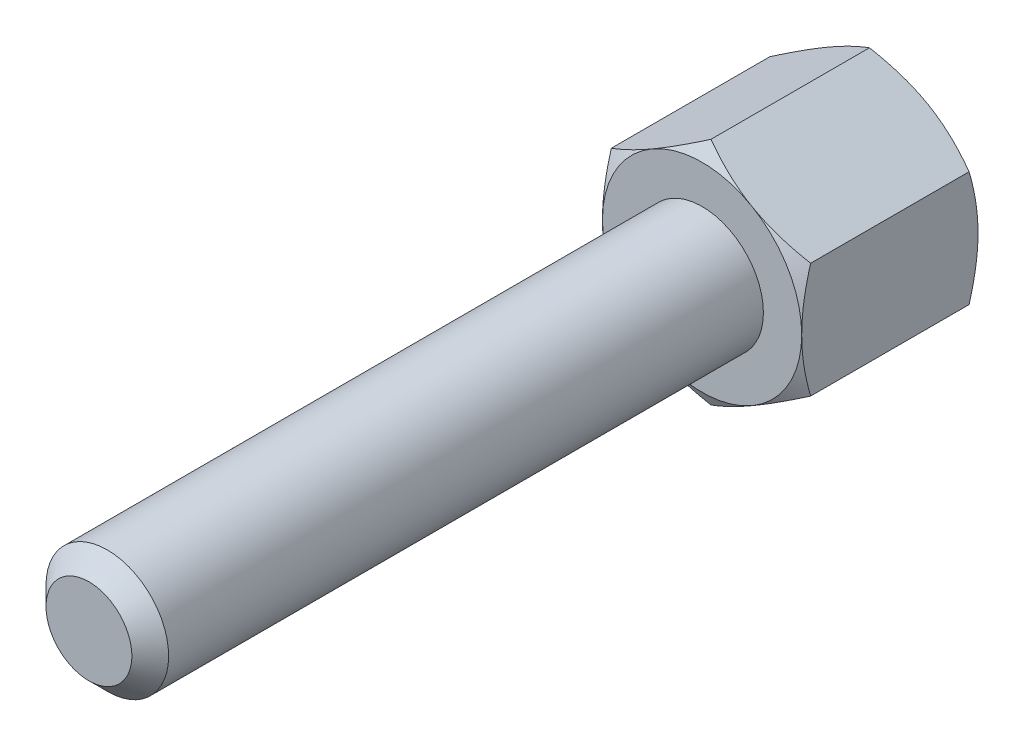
ISO-10303-21;
HEADER;
FILE_DESCRIPTION(('STEP AP214'),'2;1');
FILE_NAME('part.step','',(''),(''),'','','');
FILE_SCHEMA(('AUTOMOTIVE_DESIGN { 1 0 10303 214 1 1 1 1 }'));
ENDSEC;
DATA;
#1=APPLICATION_CONTEXT('core data for automotive mechanical design processes');
#2=APPLICATION_PROTOCOL_DEFINITION('international standard','automotive_design',2000,#1);
#3=PRODUCT_CONTEXT('',#1,'mechanical');
#4=PRODUCT('Part','Part','',(#3));
#5=PRODUCT_RELATED_PRODUCT_CATEGORY('part','',(#4));
#6=PRODUCT_DEFINITION_FORMATION('','',#4);
#7=PRODUCT_DEFINITION_CONTEXT('part definition',#1,'design');
#8=PRODUCT_DEFINITION('design','',#6,#7);
#9=PRODUCT_DEFINITION_SHAPE('','',#8);
#10=(LENGTH_UNIT() NAMED_UNIT(*) SI_UNIT(.MILLI.,.METRE.));
#11=(NAMED_UNIT(*) PLANE_ANGLE_UNIT() SI_UNIT($,.RADIAN.));
#12=(NAMED_UNIT(*) SI_UNIT($,.STERADIAN.) SOLID_ANGLE_UNIT());
#13=UNCERTAINTY_MEASURE_WITH_UNIT(LENGTH_MEASURE(1.E-05),#10,'distance_accuracy_value','');
#14=(GEOMETRIC_REPRESENTATION_CONTEXT(3) GLOBAL_UNCERTAINTY_ASSIGNED_CONTEXT((#13)) GLOBAL_UNIT_ASSIGNED_CONTEXT((#10,
#11,#12)) REPRESENTATION_CONTEXT('',''));
#15=CARTESIAN_POINT('',(0.,0.,0.));
#16=DIRECTION('',(0.,0.,1.));
#17=DIRECTION('',(1.,0.,0.));
#18=AXIS2_PLACEMENT_3D('',#15,#16,#17);
#19=CARTESIAN_POINT('',(0.,-7.50555349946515,23.));
#20=DIRECTION('',(-0.5,-0.866025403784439,0.));
#21=DIRECTION('',(-0.866025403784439,0.5,0.));
#22=AXIS2_PLACEMENT_3D('',#19,#20,#21);
#23=PLANE('',#22);
#24=DIRECTION('',(0.,0.,-1.));
#25=VECTOR('',#24,1.);
#26=CARTESIAN_POINT('',(-6.5,-3.75277674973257,23.));
#27=LINE('',#26,#25);
#28=CARTESIAN_POINT('',(-6.5,-3.75277674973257,12.4194434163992));
#29=VERTEX_POINT('',#28);
#30=CARTESIAN_POINT('',(-6.5,-3.75277674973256,2.08055658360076));
#31=VERTEX_POINT('',#30);
#32=EDGE_CURVE('E134',#29,#31,#27,.T.);
#33=ORIENTED_EDGE('',*,*,#32,.T.);
#34=CARTESIAN_POINT('',(-6.5002,-3.75266127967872,2.08062325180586));
#35=CARTESIAN_POINT('',(-6.35732254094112,-3.8351516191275,2.03300442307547));
#36=CARTESIAN_POINT('',(-6.21391236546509,-3.91794952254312,1.98754670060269));
#37=CARTESIAN_POINT('',(-5.92592736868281,-4.08421773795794,1.90154868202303));
#38=CARTESIAN_POINT('',(-5.78135207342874,-4.16768832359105,1.86101050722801));
#39=CARTESIAN_POINT('',(-5.34531134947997,-4.41943655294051,1.74757100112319));
#40=CARTESIAN_POINT('',(-5.05212471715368,-4.58870793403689,1.68304780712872));
#41=CARTESIAN_POINT('',(-4.61337625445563,-4.84201947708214,1.60738658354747));
#42=CARTESIAN_POINT('',(-4.46912536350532,-4.92530276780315,1.58583285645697));
#43=CARTESIAN_POINT('',(-4.17997178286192,-5.09224566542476,1.5496903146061));
#44=CARTESIAN_POINT('',(-4.03506915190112,-5.17590523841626,1.53510088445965));
#45=CARTESIAN_POINT('',(-3.74501222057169,-5.34336968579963,1.51325875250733));
#46=CARTESIAN_POINT('',(-3.5998583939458,-5.42717428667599,1.50599772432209));
#47=CARTESIAN_POINT('',(-3.30942466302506,-5.59485627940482,1.49896030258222));
#48=CARTESIAN_POINT('',(-3.16414476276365,-5.67873366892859,1.4991836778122));
#49=CARTESIAN_POINT('',(-2.76612405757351,-5.90853103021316,1.51008345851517));
#50=CARTESIAN_POINT('',(-2.51351353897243,-6.05437578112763,1.5283818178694));
#51=CARTESIAN_POINT('',(-2.00997032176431,-6.34509659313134,1.58640634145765));
#52=CARTESIAN_POINT('',(-1.7590393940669,-6.48997163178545,1.62615233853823));
#53=CARTESIAN_POINT('',(-1.25448277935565,-6.78127752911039,1.72550590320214));
#54=CARTESIAN_POINT('',(-1.00092075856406,-6.92767163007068,1.78553442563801));
#55=CARTESIAN_POINT('',(-0.497578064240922,-7.21827667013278,1.92177499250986));
#56=CARTESIAN_POINT('',(-0.247790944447,-7.3624913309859,1.99795503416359));
#57=CARTESIAN_POINT('',(0.000200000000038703,-7.50566896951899,2.08062325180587));
#58=B_SPLINE_CURVE_WITH_KNOTS('',3,(#34,#35,#36,#37,#38,#39,#40,#41,#42,#43,#44,#45,#46,#47,#48,
#49,#50,#51,#52,#53,#54,#55,#56,#57),.UNSPECIFIED.,.F.,.F.,(4,2,2,2,2,2,2,2,2,2,2,4),(0.,
0.515105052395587,1.03043143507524,2.06322554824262,2.56697389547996,3.07067772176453,
3.57380860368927,4.0769239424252,4.95279354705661,5.82947446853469,6.7255991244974,
7.61996451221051),.UNSPECIFIED.);
#59=CARTESIAN_POINT('',(-3.25,-5.62916512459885,1.5));
#60=VERTEX_POINT('',#59);
#61=EDGE_CURVE('E113',#31,#60,#58,.T.);
#62=ORIENTED_EDGE('',*,*,#61,.T.);
#63=CARTESIAN_POINT('',(0.,-7.50555349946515,2.08055658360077));
#64=VERTEX_POINT('',#63);
#65=EDGE_CURVE('E124',#60,#64,#58,.T.);
#66=ORIENTED_EDGE('',*,*,#65,.T.);
#67=DIRECTION('',(0.,0.,-1.));
#68=VECTOR('',#67,1.);
#69=CARTESIAN_POINT('',(0.,-7.50555349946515,23.));
#70=LINE('',#69,#68);
#71=CARTESIAN_POINT('',(0.,-7.50555349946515,12.4194434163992));
#72=VERTEX_POINT('',#71);
#73=EDGE_CURVE('E312',#72,#64,#70,.T.);
#74=ORIENTED_EDGE('',*,*,#73,.F.);
#75=CARTESIAN_POINT('',(0.000200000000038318,-7.50566896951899,12.4193767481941));
#76=CARTESIAN_POINT('',(-0.142677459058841,-7.42317863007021,12.4669955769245));
#77=CARTESIAN_POINT('',(-0.286087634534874,-7.3403807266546,12.5124532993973));
#78=CARTESIAN_POINT('',(-0.574072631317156,-7.17411251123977,12.5984513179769));
#79=CARTESIAN_POINT('',(-0.718647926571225,-7.09064192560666,12.638989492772));
#80=CARTESIAN_POINT('',(-1.15468865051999,-6.8388936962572,12.7524289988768));
#81=CARTESIAN_POINT('',(-1.44787528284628,-6.66962231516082,12.8169521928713));
#82=CARTESIAN_POINT('',(-1.88662374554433,-6.41631077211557,12.8926134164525));
#83=CARTESIAN_POINT('',(-2.03087463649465,-6.33302748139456,12.914167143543));
#84=CARTESIAN_POINT('',(-2.32002821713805,-6.16608458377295,12.9503096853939));
#85=CARTESIAN_POINT('',(-2.46493084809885,-6.08242501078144,12.9648991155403));
#86=CARTESIAN_POINT('',(-2.75498777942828,-5.91496056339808,12.9867412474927));
#87=CARTESIAN_POINT('',(-2.90014160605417,-5.83115596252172,12.9940022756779));
#88=CARTESIAN_POINT('',(-3.19057533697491,-5.66347396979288,13.0010396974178));
#89=CARTESIAN_POINT('',(-3.33585523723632,-5.57959658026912,13.0008163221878));
#90=CARTESIAN_POINT('',(-3.73387594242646,-5.34979921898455,12.9899165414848));
#91=CARTESIAN_POINT('',(-3.98648646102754,-5.20395446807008,12.9716181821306));
#92=CARTESIAN_POINT('',(-4.49002967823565,-4.91323365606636,12.9135936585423));
#93=CARTESIAN_POINT('',(-4.74096060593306,-4.76835861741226,12.8738476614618));
#94=CARTESIAN_POINT('',(-5.24551722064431,-4.47705272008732,12.7744940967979));
#95=CARTESIAN_POINT('',(-5.4990792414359,-4.33065861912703,12.714465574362));
#96=CARTESIAN_POINT('',(-6.00242193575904,-4.04005357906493,12.5782250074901));
#97=CARTESIAN_POINT('',(-6.25220905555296,-3.89583891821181,12.5020449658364));
#98=CARTESIAN_POINT('',(-6.5002,-3.75266127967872,12.4193767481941));
#99=B_SPLINE_CURVE_WITH_KNOTS('',3,(#75,#76,#77,#78,#79,#80,#81,#82,#83,#84,#85,#86,#87,#88,#89,
#90,#91,#92,#93,#94,#95,#96,#97,#98),.UNSPECIFIED.,.F.,.F.,(4,2,2,2,2,2,2,2,2,2,2,4),(0.,
0.515105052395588,1.03043143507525,2.06322554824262,2.56697389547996,3.07067772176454,
3.57380860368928,4.0769239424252,4.95279354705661,5.82947446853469,6.7255991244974,
7.6199645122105),.UNSPECIFIED.);
#100=CARTESIAN_POINT('',(-3.25,-5.62916512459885,13.));
#101=VERTEX_POINT('',#100);
#102=EDGE_CURVE('E310',#72,#101,#99,.T.);
#103=ORIENTED_EDGE('',*,*,#102,.T.);
#104=EDGE_CURVE('E199',#101,#29,#99,.T.);
#105=ORIENTED_EDGE('',*,*,#104,.T.);
#106=EDGE_LOOP('',(#33,#62,#66,#74,#103,#105));
#107=FACE_BOUND('',#106,.T.);
#108=ADVANCED_FACE('F14',(#107),#23,.T.);
#109=CARTESIAN_POINT('',(-6.5,-3.75277674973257,23.));
#110=DIRECTION('',(-1.,0.,0.));
#111=DIRECTION('',(0.,0.,-1.));
#112=AXIS2_PLACEMENT_3D('',#109,#110,#111);
#113=PLANE('',#112);
#114=DIRECTION('',(0.,0.,-1.));
#115=VECTOR('',#114,1.);
#116=CARTESIAN_POINT('',(-6.5,3.75277674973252,23.));
#117=LINE('',#116,#115);
#118=CARTESIAN_POINT('',(-6.5,3.75277674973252,12.4194434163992));
#119=VERTEX_POINT('',#118);
#120=CARTESIAN_POINT('',(-6.5,3.75277674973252,2.08055658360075));
#121=VERTEX_POINT('',#120);
#122=EDGE_CURVE('E270',#119,#121,#117,.T.);
#123=ORIENTED_EDGE('',*,*,#122,.T.);
#124=CARTESIAN_POINT('',(-6.5,-10.0686297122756,4.66645500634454));
#125=CARTESIAN_POINT('',(-6.5,-9.78483615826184,4.52883712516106));
#126=CARTESIAN_POINT('',(-6.5,-9.50038987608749,4.39254217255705));
#127=CARTESIAN_POINT('',(-6.5,-8.92984471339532,4.12334238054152));
#128=CARTESIAN_POINT('',(-6.5,-8.64374557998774,3.9904380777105));
#129=CARTESIAN_POINT('',(-6.5,-8.06806779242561,3.72809265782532));
#130=CARTESIAN_POINT('',(-6.5,-7.77847866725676,3.59867443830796));
#131=CARTESIAN_POINT('',(-6.5,-7.1969930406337,3.34514981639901));
#132=CARTESIAN_POINT('',(-6.5,-6.90509664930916,3.22104316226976));
#133=CARTESIAN_POINT('',(-6.5,-6.30914437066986,2.97567911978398));
#134=CARTESIAN_POINT('',(-6.5,-6.00499819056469,2.85463984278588));
#135=CARTESIAN_POINT('',(-6.5,-5.39314282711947,2.62175066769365));
#136=CARTESIAN_POINT('',(-6.5,-5.08543324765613,2.50990180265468));
#137=CARTESIAN_POINT('',(-6.5,-4.4665425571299,2.29833808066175));
#138=CARTESIAN_POINT('',(-6.5,-4.15536996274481,2.19859855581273));
#139=CARTESIAN_POINT('',(-6.5,-3.52855782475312,2.01446301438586));
#140=CARTESIAN_POINT('',(-6.5,-3.21291972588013,1.9300621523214));
#141=CARTESIAN_POINT('',(-6.5,-2.57876921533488,1.78110829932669));
#142=CARTESIAN_POINT('',(-6.5,-2.26028247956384,1.71644774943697));
#143=CARTESIAN_POINT('',(-6.5,-1.61931557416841,1.61065008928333));
#144=CARTESIAN_POINT('',(-6.5,-1.29683578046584,1.56951078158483));
#145=CARTESIAN_POINT('',(-6.5,-0.813547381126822,1.52817461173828));
#146=CARTESIAN_POINT('',(-6.5,-0.653569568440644,1.51779431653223));
#147=CARTESIAN_POINT('',(-6.5,-0.333311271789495,1.50380157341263));
#148=CARTESIAN_POINT('',(-6.5,-0.173030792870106,1.50018901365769));
#149=CARTESIAN_POINT('',(-6.5,0.147537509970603,1.49982541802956));
#150=CARTESIAN_POINT('',(-6.5,0.307825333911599,1.50307440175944));
#151=CARTESIAN_POINT('',(-6.5,0.628122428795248,1.51635267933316));
#152=CARTESIAN_POINT('',(-6.5,0.788131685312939,1.52638231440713));
#153=CARTESIAN_POINT('',(-6.5,1.17304986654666,1.55845438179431));
#154=CARTESIAN_POINT('',(-6.5,1.39769460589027,1.58373467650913));
#155=CARTESIAN_POINT('',(-6.5,1.84529842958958,1.64627911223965));
#156=CARTESIAN_POINT('',(-6.5,2.06825727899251,1.68354489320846));
#157=CARTESIAN_POINT('',(-6.5,2.73436107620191,1.81134295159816));
#158=CARTESIAN_POINT('',(-6.5,3.17448023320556,1.91785208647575));
#159=CARTESIAN_POINT('',(-6.5,3.83253872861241,2.102314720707));
#160=CARTESIAN_POINT('',(-6.5,4.053897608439,2.16876892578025));
#161=CARTESIAN_POINT('',(-6.5,4.49446508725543,2.3085224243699));
#162=CARTESIAN_POINT('',(-6.5,4.71367367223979,2.38182176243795));
#163=CARTESIAN_POINT('',(-6.5,5.15001039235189,2.53409424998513));
#164=CARTESIAN_POINT('',(-6.5,5.36713920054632,2.61306548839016));
#165=CARTESIAN_POINT('',(-6.5,5.799601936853,2.77575833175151));
#166=CARTESIAN_POINT('',(-6.5,6.01493588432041,2.85947988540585));
#167=CARTESIAN_POINT('',(-6.5,6.51613914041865,3.05969844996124));
#168=CARTESIAN_POINT('',(-6.5,6.8013853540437,3.17775218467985));
#169=CARTESIAN_POINT('',(-6.5,7.36950297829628,3.4194578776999));
#170=CARTESIAN_POINT('',(-6.5,7.65237425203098,3.54311015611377));
#171=CARTESIAN_POINT('',(-6.5,8.21616884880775,3.79490928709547));
#172=CARTESIAN_POINT('',(-6.5,8.49709178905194,3.92305699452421));
#173=CARTESIAN_POINT('',(-6.5,9.05726492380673,4.18296407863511));
#174=CARTESIAN_POINT('',(-6.5,9.33651508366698,4.31472352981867));
#175=CARTESIAN_POINT('',(-6.5,9.89389202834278,4.58132185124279));
#176=CARTESIAN_POINT('',(-6.5,10.172017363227,4.71616374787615));
#177=CARTESIAN_POINT('',(-6.5,10.727076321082,4.98828060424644));
#178=CARTESIAN_POINT('',(-6.5,11.004009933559,5.12555558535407));
#179=CARTESIAN_POINT('',(-6.5,11.8332331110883,5.540358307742));
#180=CARTESIAN_POINT('',(-6.5,12.3840158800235,5.82089799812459));
#181=CARTESIAN_POINT('',(-6.5,13.4376729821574,6.36445572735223));
#182=CARTESIAN_POINT('',(-6.5,13.9407782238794,6.62702814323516));
#183=CARTESIAN_POINT('',(-6.5,14.9451021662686,7.15579431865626));
#184=CARTESIAN_POINT('',(-6.5,15.4463208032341,7.42198819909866));
#185=CARTESIAN_POINT('',(-6.5,16.4460730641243,7.95649533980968));
#186=CARTESIAN_POINT('',(-6.5,16.9446102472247,8.22480195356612));
#187=CARTESIAN_POINT('',(-6.5,17.9404739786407,8.76359021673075));
#188=CARTESIAN_POINT('',(-6.5,18.4378005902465,9.03407174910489));
#189=CARTESIAN_POINT('',(-6.5,18.9346796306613,9.30536745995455));
#190=B_SPLINE_CURVE_WITH_KNOTS('',3,(#124,#125,#126,#127,#128,#129,#130,#131,#132,#133,#134,
#135,#136,#137,#138,#139,#140,#141,#142,#143,#144,#145,#146,#147,#148,#149,#150,#151,#152,#153,
#154,#155,#156,#157,#158,#159,#160,#161,#162,#163,#164,#165,#166,#167,#168,#169,#170,#171,#172,
#173,#174,#175,#176,#177,#178,#179,#180,#181,#182,#183,#184,#185,#186,#187,#188,#189),
.UNSPECIFIED.,.F.,.F.,(4,2,2,2,2,2,2,2,2,2,2,2,2,2,2,2,2,2,2,2,2,2,2,2,2,2,2,2,2,2,2,2,4),(0.,
0.946213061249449,1.89257494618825,2.8441090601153,3.79559802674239,4.77752138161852,
5.75955495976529,6.73955322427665,7.7192413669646,8.69349208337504,9.66765176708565,
10.1484730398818,10.6292863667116,11.1101010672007,11.5909399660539,12.2687449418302,
12.9466426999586,14.3031972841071,14.9964966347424,15.6898004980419,16.3828718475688,
17.0759357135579,18.0019870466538,18.9280913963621,19.8543728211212,20.7806733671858,
21.7079261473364,22.6351870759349,24.4894729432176,26.1919648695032,27.8945137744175,
29.5929631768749,31.2913217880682),.UNSPECIFIED.);
#191=CARTESIAN_POINT('',(-6.5,0.,1.5));
#192=VERTEX_POINT('',#191);
#193=EDGE_CURVE('E253',#121,#192,#190,.F.);
#194=ORIENTED_EDGE('',*,*,#193,.T.);
#195=EDGE_CURVE('E115',#192,#31,#190,.F.);
#196=ORIENTED_EDGE('',*,*,#195,.T.);
#197=ORIENTED_EDGE('',*,*,#32,.F.);
#198=CARTESIAN_POINT('',(-6.5,-10.0686297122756,9.83354499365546));
#199=CARTESIAN_POINT('',(-6.5,-9.78483615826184,9.97116287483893));
#200=CARTESIAN_POINT('',(-6.5,-9.50038987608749,10.1074578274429));
#201=CARTESIAN_POINT('',(-6.5,-8.92984471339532,10.3766576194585));
#202=CARTESIAN_POINT('',(-6.5,-8.64374557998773,10.5095619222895));
#203=CARTESIAN_POINT('',(-6.5,-8.0680677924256,10.7719073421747));
#204=CARTESIAN_POINT('',(-6.5,-7.77847866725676,10.901325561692));
#205=CARTESIAN_POINT('',(-6.5,-7.1969930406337,11.154850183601));
#206=CARTESIAN_POINT('',(-6.5,-6.90509664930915,11.2789568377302));
#207=CARTESIAN_POINT('',(-6.5,-6.30914437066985,11.524320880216));
#208=CARTESIAN_POINT('',(-6.5,-6.00499819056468,11.6453601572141));
#209=CARTESIAN_POINT('',(-6.5,-5.39314282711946,11.8782493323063));
#210=CARTESIAN_POINT('',(-6.5,-5.08543324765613,11.9900981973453));
#211=CARTESIAN_POINT('',(-6.5,-4.46654255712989,12.2016619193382));
#212=CARTESIAN_POINT('',(-6.5,-4.1553699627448,12.3014014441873));
#213=CARTESIAN_POINT('',(-6.5,-3.52855782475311,12.4855369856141));
#214=CARTESIAN_POINT('',(-6.5,-3.21291972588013,12.5699378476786));
#215=CARTESIAN_POINT('',(-6.5,-2.57876921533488,12.7188917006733));
#216=CARTESIAN_POINT('',(-6.5,-2.26028247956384,12.783552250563));
#217=CARTESIAN_POINT('',(-6.5,-1.61931557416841,12.8893499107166));
#218=CARTESIAN_POINT('',(-6.5,-1.29683578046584,12.9304892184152));
#219=CARTESIAN_POINT('',(-6.5,-0.813547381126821,12.9718253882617));
#220=CARTESIAN_POINT('',(-6.5,-0.653569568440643,12.9822056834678));
#221=CARTESIAN_POINT('',(-6.5,-0.333311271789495,12.9961984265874));
#222=CARTESIAN_POINT('',(-6.5,-0.173030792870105,12.9998109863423));
#223=CARTESIAN_POINT('',(-6.5,0.147537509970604,13.0001745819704));
#224=CARTESIAN_POINT('',(-6.5,0.3078253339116,12.9969255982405));
#225=CARTESIAN_POINT('',(-6.5,0.628122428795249,12.9836473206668));
#226=CARTESIAN_POINT('',(-6.5,0.788131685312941,12.9736176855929));
#227=CARTESIAN_POINT('',(-6.5,1.17304986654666,12.9415456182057));
#228=CARTESIAN_POINT('',(-6.5,1.39769460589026,12.9162653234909));
#229=CARTESIAN_POINT('',(-6.5,1.84529842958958,12.8537208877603));
#230=CARTESIAN_POINT('',(-6.5,2.0682572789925,12.8164551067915));
#231=CARTESIAN_POINT('',(-6.5,2.7343610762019,12.6886570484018));
#232=CARTESIAN_POINT('',(-6.5,3.17448023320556,12.5821479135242));
#233=CARTESIAN_POINT('',(-6.5,3.8325387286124,12.397685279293));
#234=CARTESIAN_POINT('',(-6.5,4.05389760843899,12.3312310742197));
#235=CARTESIAN_POINT('',(-6.5,4.49446508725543,12.1914775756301));
#236=CARTESIAN_POINT('',(-6.5,4.71367367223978,12.118178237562));
#237=CARTESIAN_POINT('',(-6.5,5.15001039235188,11.9659057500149));
#238=CARTESIAN_POINT('',(-6.5,5.36713920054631,11.8869345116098));
#239=CARTESIAN_POINT('',(-6.5,5.79960193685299,11.7242416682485));
#240=CARTESIAN_POINT('',(-6.5,6.01493588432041,11.6405201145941));
#241=CARTESIAN_POINT('',(-6.5,6.51613914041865,11.4403015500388));
#242=CARTESIAN_POINT('',(-6.5,6.80138535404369,11.3222478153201));
#243=CARTESIAN_POINT('',(-6.5,7.36950297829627,11.0805421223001));
#244=CARTESIAN_POINT('',(-6.5,7.65237425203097,10.9568898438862));
#245=CARTESIAN_POINT('',(-6.5,8.21616884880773,10.7050907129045));
#246=CARTESIAN_POINT('',(-6.5,8.49709178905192,10.5769430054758));
#247=CARTESIAN_POINT('',(-6.5,9.05726492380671,10.3170359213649));
#248=CARTESIAN_POINT('',(-6.5,9.33651508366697,10.1852764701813));
#249=CARTESIAN_POINT('',(-6.5,9.89389202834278,9.91867814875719));
#250=CARTESIAN_POINT('',(-6.5,10.1720173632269,9.78383625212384));
#251=CARTESIAN_POINT('',(-6.5,10.727076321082,9.51171939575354));
#252=CARTESIAN_POINT('',(-6.5,11.004009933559,9.37444441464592));
#253=CARTESIAN_POINT('',(-6.5,11.8332331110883,8.95964169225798));
#254=CARTESIAN_POINT('',(-6.5,12.3840158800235,8.6791020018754));
#255=CARTESIAN_POINT('',(-6.5,13.4376729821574,8.13554427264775));
#256=CARTESIAN_POINT('',(-6.5,13.9407782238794,7.87297185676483));
#257=CARTESIAN_POINT('',(-6.5,14.9451021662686,7.34420568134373));
#258=CARTESIAN_POINT('',(-6.5,15.4463208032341,7.07801180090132));
#259=CARTESIAN_POINT('',(-6.5,16.4460730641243,6.54350466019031));
#260=CARTESIAN_POINT('',(-6.5,16.9446102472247,6.27519804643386));
#261=CARTESIAN_POINT('',(-6.5,17.9404739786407,5.73640978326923));
#262=CARTESIAN_POINT('',(-6.5,18.4378005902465,5.46592825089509));
#263=CARTESIAN_POINT('',(-6.5,18.9346796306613,5.19463254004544));
#264=B_SPLINE_CURVE_WITH_KNOTS('',3,(#198,#199,#200,#201,#202,#203,#204,#205,#206,#207,#208,
#209,#210,#211,#212,#213,#214,#215,#216,#217,#218,#219,#220,#221,#222,#223,#224,#225,#226,#227,
#228,#229,#230,#231,#232,#233,#234,#235,#236,#237,#238,#239,#240,#241,#242,#243,#244,#245,#246,
#247,#248,#249,#250,#251,#252,#253,#254,#255,#256,#257,#258,#259,#260,#261,#262,#263),
.UNSPECIFIED.,.F.,.F.,(4,2,2,2,2,2,2,2,2,2,2,2,2,2,2,2,2,2,2,2,2,2,2,2,2,2,2,2,2,2,2,2,4),(0.,
0.946213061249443,1.89257494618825,2.8441090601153,3.79559802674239,4.77752138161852,
5.75955495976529,6.73955322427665,7.71924136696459,8.69349208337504,9.66765176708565,
10.1484730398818,10.6292863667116,11.1101010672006,11.5909399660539,12.2687449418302,
12.9466426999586,14.3031972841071,14.9964966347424,15.6898004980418,16.3828718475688,
17.0759357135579,18.0019870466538,18.928091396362,19.8543728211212,20.7806733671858,
21.7079261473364,22.6351870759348,24.4894729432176,26.1919648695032,27.8945137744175,
29.5929631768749,31.2913217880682),.UNSPECIFIED.);
#265=CARTESIAN_POINT('',(-6.5,0.,13.));
#266=VERTEX_POINT('',#265);
#267=EDGE_CURVE('E209',#29,#266,#264,.T.);
#268=ORIENTED_EDGE('',*,*,#267,.T.);
#269=EDGE_CURVE('E229',#266,#119,#264,.T.);
#270=ORIENTED_EDGE('',*,*,#269,.T.);
#271=EDGE_LOOP('',(#123,#194,#196,#197,#268,#270));
#272=FACE_BOUND('',#271,.T.);
#273=ADVANCED_FACE('F233',(#272),#113,.T.);
#274=CARTESIAN_POINT('',(0.,7.50555349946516,23.));
#275=DIRECTION('',(0.500000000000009,-0.866025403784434,0.));
#276=DIRECTION('',(-0.866025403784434,-0.500000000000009,0.));
#277=AXIS2_PLACEMENT_3D('',#274,#275,#276);
#278=PLANE('',#277);
#279=CARTESIAN_POINT('',(-6.5002,3.75266127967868,2.08062325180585));
#280=CARTESIAN_POINT('',(-6.35732254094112,3.83515161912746,2.03300442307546));
#281=CARTESIAN_POINT('',(-6.21391236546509,3.91794952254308,1.98754670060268));
#282=CARTESIAN_POINT('',(-5.92592736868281,4.08421773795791,1.90154868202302));
#283=CARTESIAN_POINT('',(-5.78135207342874,4.16768832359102,1.861010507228));
#284=CARTESIAN_POINT('',(-5.34531134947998,4.41943655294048,1.74757100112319));
#285=CARTESIAN_POINT('',(-5.05212471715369,4.58870793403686,1.68304780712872));
#286=CARTESIAN_POINT('',(-4.61337625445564,4.84201947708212,1.60738658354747));
#287=CARTESIAN_POINT('',(-4.46912536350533,4.92530276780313,1.58583285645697));
#288=CARTESIAN_POINT('',(-4.17997178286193,5.09224566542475,1.5496903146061));
#289=CARTESIAN_POINT('',(-4.03506915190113,5.17590523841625,1.53510088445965));
#290=CARTESIAN_POINT('',(-3.7450122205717,5.34336968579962,1.51325875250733));
#291=CARTESIAN_POINT('',(-3.59985839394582,5.42717428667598,1.50599772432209));
#292=CARTESIAN_POINT('',(-3.30942466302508,5.59485627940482,1.49896030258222));
#293=CARTESIAN_POINT('',(-3.16414476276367,5.67873366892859,1.4991836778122));
#294=CARTESIAN_POINT('',(-2.76612405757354,5.90853103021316,1.51008345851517));
#295=CARTESIAN_POINT('',(-2.51351353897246,6.05437578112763,1.52838181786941));
#296=CARTESIAN_POINT('',(-2.00997032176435,6.34509659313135,1.58640634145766));
#297=CARTESIAN_POINT('',(-1.75903939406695,6.48997163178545,1.62615233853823));
#298=CARTESIAN_POINT('',(-1.25448277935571,6.7812775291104,1.72550590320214));
#299=CARTESIAN_POINT('',(-1.00092075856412,6.92767163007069,1.78553442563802));
#300=CARTESIAN_POINT('',(-0.497578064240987,7.21827667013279,1.92177499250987));
#301=CARTESIAN_POINT('',(-0.247790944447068,7.36249133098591,1.99795503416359));
#302=CARTESIAN_POINT('',(0.000199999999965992,7.505668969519,2.08062325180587));
#303=B_SPLINE_CURVE_WITH_KNOTS('',3,(#279,#280,#281,#282,#283,#284,#285,#286,#287,#288,#289,
#290,#291,#292,#293,#294,#295,#296,#297,#298,#299,#300,#301,#302),.UNSPECIFIED.,.F.,.F.,(4,2,2,
2,2,2,2,2,2,2,2,4),(0.,0.515105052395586,1.03043143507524,2.06322554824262,2.56697389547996,
3.07067772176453,3.57380860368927,4.07692394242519,4.9527935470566,5.82947446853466,
6.72559912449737,7.61996451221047),.UNSPECIFIED.);
#304=CARTESIAN_POINT('',(-3.25000000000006,5.62916512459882,1.5));
#305=VERTEX_POINT('',#304);
#306=EDGE_CURVE('E244',#121,#305,#303,.T.);
#307=ORIENTED_EDGE('',*,*,#306,.F.);
#308=ORIENTED_EDGE('',*,*,#122,.F.);
#309=CARTESIAN_POINT('',(0.000199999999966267,7.505668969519,12.4193767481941));
#310=CARTESIAN_POINT('',(-0.142677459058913,7.42317863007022,12.4669955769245));
#311=CARTESIAN_POINT('',(-0.286087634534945,7.3403807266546,12.5124532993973));
#312=CARTESIAN_POINT('',(-0.574072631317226,7.17411251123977,12.5984513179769));
#313=CARTESIAN_POINT('',(-0.718647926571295,7.09064192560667,12.638989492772));
#314=CARTESIAN_POINT('',(-1.15468865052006,6.8388936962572,12.7524289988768));
#315=CARTESIAN_POINT('',(-1.44787528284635,6.66962231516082,12.8169521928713));
#316=CARTESIAN_POINT('',(-1.8866237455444,6.41631077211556,12.8926134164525));
#317=CARTESIAN_POINT('',(-2.03087463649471,6.33302748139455,12.914167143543));
#318=CARTESIAN_POINT('',(-2.32002821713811,6.16608458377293,12.9503096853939));
#319=CARTESIAN_POINT('',(-2.46493084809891,6.08242501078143,12.9648991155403));
#320=CARTESIAN_POINT('',(-2.75498777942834,5.91496056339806,12.9867412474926));
#321=CARTESIAN_POINT('',(-2.90014160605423,5.8311559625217,12.9940022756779));
#322=CARTESIAN_POINT('',(-3.19057533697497,5.66347396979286,13.0010396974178));
#323=CARTESIAN_POINT('',(-3.33585523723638,5.57959658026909,13.0008163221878));
#324=CARTESIAN_POINT('',(-3.73387594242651,5.34979921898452,12.9899165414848));
#325=CARTESIAN_POINT('',(-3.98648646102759,5.20395446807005,12.9716181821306));
#326=CARTESIAN_POINT('',(-4.49002967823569,4.91323365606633,12.9135936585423));
#327=CARTESIAN_POINT('',(-4.74096060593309,4.76835861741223,12.8738476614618));
#328=CARTESIAN_POINT('',(-5.24551722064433,4.47705272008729,12.7744940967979));
#329=CARTESIAN_POINT('',(-5.49907924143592,4.33065861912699,12.714465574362));
#330=CARTESIAN_POINT('',(-6.00242193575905,4.0400535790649,12.5782250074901));
#331=CARTESIAN_POINT('',(-6.25220905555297,3.89583891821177,12.5020449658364));
#332=CARTESIAN_POINT('',(-6.5002,3.75266127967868,12.4193767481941));
#333=B_SPLINE_CURVE_WITH_KNOTS('',3,(#309,#310,#311,#312,#313,#314,#315,#316,#317,#318,#319,
#320,#321,#322,#323,#324,#325,#326,#327,#328,#329,#330,#331,#332),.UNSPECIFIED.,.F.,.F.,(4,2,2,
2,2,2,2,2,2,2,2,4),(0.,0.515105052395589,1.03043143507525,2.06322554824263,2.56697389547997,
3.07067772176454,3.57380860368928,4.07692394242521,4.95279354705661,5.82947446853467,
6.72559912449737,7.61996451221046),.UNSPECIFIED.);
#334=CARTESIAN_POINT('',(-3.25000000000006,5.62916512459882,13.));
#335=VERTEX_POINT('',#334);
#336=EDGE_CURVE('E223',#335,#119,#333,.T.);
#337=ORIENTED_EDGE('',*,*,#336,.F.);
#338=CARTESIAN_POINT('',(0.,7.50555349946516,12.4194434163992));
#339=VERTEX_POINT('',#338);
#340=EDGE_CURVE('E228',#339,#335,#333,.T.);
#341=ORIENTED_EDGE('',*,*,#340,.F.);
#342=DIRECTION('',(0.,0.,-1.));
#343=VECTOR('',#342,1.);
#344=CARTESIAN_POINT('',(0.,7.50555349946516,23.));
#345=LINE('',#344,#343);
#346=CARTESIAN_POINT('',(0.,7.50555349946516,2.08055658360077));
#347=VERTEX_POINT('',#346);
#348=EDGE_CURVE('E278',#339,#347,#345,.T.);
#349=ORIENTED_EDGE('',*,*,#348,.T.);
#350=EDGE_CURVE('E238',#305,#347,#303,.T.);
#351=ORIENTED_EDGE('',*,*,#350,.F.);
#352=EDGE_LOOP('',(#307,#308,#337,#341,#349,#351));
#353=FACE_BOUND('',#352,.T.);
#354=ADVANCED_FACE('F230',(#353),#278,.F.);
#355=CARTESIAN_POINT('',(0.,7.50555349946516,23.));
#356=DIRECTION('',(0.5,0.866025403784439,0.));
#357=DIRECTION('',(0.866025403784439,-0.5,0.));
#358=AXIS2_PLACEMENT_3D('',#355,#356,#357);
#359=PLANE('',#358);
#360=DIRECTION('',(0.,0.,-1.));
#361=VECTOR('',#360,1.);
#362=CARTESIAN_POINT('',(6.5,3.75277674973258,23.));
#363=LINE('',#362,#361);
#364=CARTESIAN_POINT('',(6.5,3.75277674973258,12.4194434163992));
#365=VERTEX_POINT('',#364);
#366=CARTESIAN_POINT('',(6.5,3.75277674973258,2.08055658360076));
#367=VERTEX_POINT('',#366);
#368=EDGE_CURVE('E290',#365,#367,#363,.T.);
#369=ORIENTED_EDGE('',*,*,#368,.T.);
#370=CARTESIAN_POINT('',(6.5002,3.75266127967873,2.08062325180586));
#371=CARTESIAN_POINT('',(6.35732254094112,3.83515161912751,2.03300442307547));
#372=CARTESIAN_POINT('',(6.21391236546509,3.91794952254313,1.98754670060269));
#373=CARTESIAN_POINT('',(5.92592736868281,4.08421773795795,1.90154868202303));
#374=CARTESIAN_POINT('',(5.78135207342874,4.16768832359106,1.86101050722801));
#375=CARTESIAN_POINT('',(5.34531134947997,4.41943655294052,1.7475710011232));
#376=CARTESIAN_POINT('',(5.05212471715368,4.5887079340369,1.68304780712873));
#377=CARTESIAN_POINT('',(4.61337625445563,4.84201947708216,1.60738658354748));
#378=CARTESIAN_POINT('',(4.46912536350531,4.92530276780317,1.58583285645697));
#379=CARTESIAN_POINT('',(4.17997178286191,5.09224566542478,1.54969031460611));
#380=CARTESIAN_POINT('',(4.03506915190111,5.17590523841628,1.53510088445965));
#381=CARTESIAN_POINT('',(3.74501222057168,5.34336968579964,1.51325875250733));
#382=CARTESIAN_POINT('',(3.59985839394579,5.427174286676,1.50599772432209));
#383=CARTESIAN_POINT('',(3.30942466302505,5.59485627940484,1.49896030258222));
#384=CARTESIAN_POINT('',(3.16414476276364,5.67873366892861,1.4991836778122));
#385=CARTESIAN_POINT('',(2.7661240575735,5.90853103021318,1.51008345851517));
#386=CARTESIAN_POINT('',(2.51351353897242,6.05437578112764,1.52838181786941));
#387=CARTESIAN_POINT('',(2.00997032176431,6.34509659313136,1.58640634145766));
#388=CARTESIAN_POINT('',(1.7590393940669,6.48997163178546,1.62615233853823));
#389=CARTESIAN_POINT('',(1.25448277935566,6.7812775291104,1.72550590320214));
#390=CARTESIAN_POINT('',(1.00092075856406,6.9276716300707,1.78553442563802));
#391=CARTESIAN_POINT('',(0.497578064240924,7.21827667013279,1.92177499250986));
#392=CARTESIAN_POINT('',(0.247790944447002,7.36249133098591,1.99795503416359));
#393=CARTESIAN_POINT('',(-0.000200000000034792,7.505668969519,2.08062325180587));
#394=B_SPLINE_CURVE_WITH_KNOTS('',3,(#370,#371,#372,#373,#374,#375,#376,#377,#378,#379,#380,
#381,#382,#383,#384,#385,#386,#387,#388,#389,#390,#391,#392,#393),.UNSPECIFIED.,.F.,.F.,(4,2,2,
2,2,2,2,2,2,2,2,4),(0.,0.515105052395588,1.03043143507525,2.06322554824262,2.56697389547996,
3.07067772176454,3.57380860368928,4.0769239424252,4.95279354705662,5.82947446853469,
6.7255991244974,7.6199645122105),.UNSPECIFIED.);
#395=CARTESIAN_POINT('',(3.25,5.62916512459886,1.5));
#396=VERTEX_POINT('',#395);
#397=EDGE_CURVE('E129',#367,#396,#394,.T.);
#398=ORIENTED_EDGE('',*,*,#397,.T.);
#399=EDGE_CURVE('E135',#396,#347,#394,.T.);
#400=ORIENTED_EDGE('',*,*,#399,.T.);
#401=ORIENTED_EDGE('',*,*,#348,.F.);
#402=CARTESIAN_POINT('',(-0.000200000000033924,7.505668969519,12.4193767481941));
#403=CARTESIAN_POINT('',(0.142677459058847,7.42317863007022,12.4669955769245));
#404=CARTESIAN_POINT('',(0.286087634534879,7.3403807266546,12.5124532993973));
#405=CARTESIAN_POINT('',(0.574072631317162,7.17411251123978,12.5984513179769));
#406=CARTESIAN_POINT('',(0.718647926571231,7.09064192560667,12.638989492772));
#407=CARTESIAN_POINT('',(1.15468865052,6.83889369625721,12.7524289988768));
#408=CARTESIAN_POINT('',(1.44787528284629,6.66962231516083,12.8169521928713));
#409=CARTESIAN_POINT('',(1.88662374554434,6.41631077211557,12.8926134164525));
#410=CARTESIAN_POINT('',(2.03087463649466,6.33302748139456,12.914167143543));
#411=CARTESIAN_POINT('',(2.32002821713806,6.16608458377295,12.9503096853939));
#412=CARTESIAN_POINT('',(2.46493084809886,6.08242501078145,12.9648991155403));
#413=CARTESIAN_POINT('',(2.75498777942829,5.91496056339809,12.9867412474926));
#414=CARTESIAN_POINT('',(2.90014160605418,5.83115596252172,12.9940022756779));
#415=CARTESIAN_POINT('',(3.19057533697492,5.66347396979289,13.0010396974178));
#416=CARTESIAN_POINT('',(3.33585523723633,5.57959658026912,13.0008163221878));
#417=CARTESIAN_POINT('',(3.73387594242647,5.34979921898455,12.9899165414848));
#418=CARTESIAN_POINT('',(3.98648646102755,5.20395446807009,12.9716181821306));
#419=CARTESIAN_POINT('',(4.49002967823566,4.91323365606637,12.9135936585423));
#420=CARTESIAN_POINT('',(4.74096060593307,4.76835861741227,12.8738476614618));
#421=CARTESIAN_POINT('',(5.24551722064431,4.47705272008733,12.7744940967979));
#422=CARTESIAN_POINT('',(5.49907924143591,4.33065861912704,12.714465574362));
#423=CARTESIAN_POINT('',(6.00242193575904,4.04005357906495,12.5782250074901));
#424=CARTESIAN_POINT('',(6.25220905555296,3.89583891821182,12.5020449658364));
#425=CARTESIAN_POINT('',(6.5002,3.75266127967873,12.4193767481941));
#426=B_SPLINE_CURVE_WITH_KNOTS('',3,(#402,#403,#404,#405,#406,#407,#408,#409,#410,#411,#412,
#413,#414,#415,#416,#417,#418,#419,#420,#421,#422,#423,#424,#425),.UNSPECIFIED.,.F.,.F.,(4,2,2,
2,2,2,2,2,2,2,2,4),(0.,0.515105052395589,1.03043143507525,2.06322554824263,2.56697389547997,
3.07067772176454,3.57380860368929,4.07692394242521,4.95279354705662,5.82947446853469,
6.72559912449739,7.61996451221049),.UNSPECIFIED.);
#427=CARTESIAN_POINT('',(3.25,5.62916512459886,13.));
#428=VERTEX_POINT('',#427);
#429=EDGE_CURVE('E179',#339,#428,#426,.T.);
#430=ORIENTED_EDGE('',*,*,#429,.T.);
#431=EDGE_CURVE('E178',#428,#365,#426,.T.);
#432=ORIENTED_EDGE('',*,*,#431,.T.);
#433=EDGE_LOOP('',(#369,#398,#400,#401,#430,#432));
#434=FACE_BOUND('',#433,.T.);
#435=ADVANCED_FACE('F163',(#434),#359,.T.);
#436=CARTESIAN_POINT('',(6.5,-3.75277674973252,23.));
#437=DIRECTION('',(-1.,0.,0.));
#438=DIRECTION('',(0.,0.,-1.));
#439=AXIS2_PLACEMENT_3D('',#436,#437,#438);
#440=PLANE('',#439);
#441=CARTESIAN_POINT('',(6.5,-10.0686297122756,4.66645500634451));
#442=CARTESIAN_POINT('',(6.5,-9.78483615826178,4.52883712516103));
#443=CARTESIAN_POINT('',(6.5,-9.50038987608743,4.39254217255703));
#444=CARTESIAN_POINT('',(6.5,-8.92984471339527,4.1233423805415));
#445=CARTESIAN_POINT('',(6.5,-8.64374557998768,3.99043807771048));
#446=CARTESIAN_POINT('',(6.5,-8.06806779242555,3.7280926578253));
#447=CARTESIAN_POINT('',(6.5,-7.7784786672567,3.59867443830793));
#448=CARTESIAN_POINT('',(6.5,-7.19699304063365,3.34514981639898));
#449=CARTESIAN_POINT('',(6.5,-6.9050966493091,3.22104316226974));
#450=CARTESIAN_POINT('',(6.5,-6.30914437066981,2.97567911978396));
#451=CARTESIAN_POINT('',(6.5,-6.00499819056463,2.85463984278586));
#452=CARTESIAN_POINT('',(6.5,-5.39314282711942,2.62175066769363));
#453=CARTESIAN_POINT('',(6.5,-5.08543324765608,2.50990180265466));
#454=CARTESIAN_POINT('',(6.5,-4.46654255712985,2.29833808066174));
#455=CARTESIAN_POINT('',(6.5,-4.15536996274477,2.19859855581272));
#456=CARTESIAN_POINT('',(6.5,-3.52855782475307,2.01446301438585));
#457=CARTESIAN_POINT('',(6.5,-3.21291972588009,1.93006215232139));
#458=CARTESIAN_POINT('',(6.5,-2.57876921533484,1.78110829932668));
#459=CARTESIAN_POINT('',(6.5,-2.2602824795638,1.71644774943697));
#460=CARTESIAN_POINT('',(6.5,-1.61931557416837,1.61065008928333));
#461=CARTESIAN_POINT('',(6.5,-1.2968357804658,1.56951078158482));
#462=CARTESIAN_POINT('',(6.5,-0.813547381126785,1.52817461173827));
#463=CARTESIAN_POINT('',(6.5,-0.653569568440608,1.51779431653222));
#464=CARTESIAN_POINT('',(6.5,-0.33331127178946,1.50380157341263));
#465=CARTESIAN_POINT('',(6.5,-0.17303079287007,1.50018901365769));
#466=CARTESIAN_POINT('',(6.5,0.147537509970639,1.49982541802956));
#467=CARTESIAN_POINT('',(6.5,0.307825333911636,1.50307440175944));
#468=CARTESIAN_POINT('',(6.5,0.628122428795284,1.51635267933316));
#469=CARTESIAN_POINT('',(6.5,0.788131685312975,1.52638231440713));
#470=CARTESIAN_POINT('',(6.5,1.1730498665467,1.55845438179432));
#471=CARTESIAN_POINT('',(6.5,1.3976946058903,1.58373467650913));
#472=CARTESIAN_POINT('',(6.5,1.84529842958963,1.64627911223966));
#473=CARTESIAN_POINT('',(6.5,2.06825727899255,1.68354489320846));
#474=CARTESIAN_POINT('',(6.5,2.73436107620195,1.81134295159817));
#475=CARTESIAN_POINT('',(6.5,3.17448023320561,1.91785208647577));
#476=CARTESIAN_POINT('',(6.5,3.83253872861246,2.10231472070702));
#477=CARTESIAN_POINT('',(6.5,4.05389760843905,2.16876892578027));
#478=CARTESIAN_POINT('',(6.5,4.49446508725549,2.30852242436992));
#479=CARTESIAN_POINT('',(6.5,4.71367367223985,2.38182176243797));
#480=CARTESIAN_POINT('',(6.5,5.15001039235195,2.53409424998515));
#481=CARTESIAN_POINT('',(6.5,5.36713920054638,2.61306548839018));
#482=CARTESIAN_POINT('',(6.5,5.79960193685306,2.77575833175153));
#483=CARTESIAN_POINT('',(6.5,6.01493588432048,2.85947988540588));
#484=CARTESIAN_POINT('',(6.5,6.51613914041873,3.05969844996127));
#485=CARTESIAN_POINT('',(6.5,6.80138535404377,3.17775218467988));
#486=CARTESIAN_POINT('',(6.5,7.36950297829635,3.41945787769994));
#487=CARTESIAN_POINT('',(6.5,7.65237425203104,3.5431101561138));
#488=CARTESIAN_POINT('',(6.5,8.21616884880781,3.7949092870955));
#489=CARTESIAN_POINT('',(6.5,8.497091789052,3.92305699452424));
#490=CARTESIAN_POINT('',(6.5,9.05726492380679,4.18296407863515));
#491=CARTESIAN_POINT('',(6.5,9.33651508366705,4.3147235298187));
#492=CARTESIAN_POINT('',(6.5,9.89389202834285,4.58132185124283));
#493=CARTESIAN_POINT('',(6.5,10.172017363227,4.71616374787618));
#494=CARTESIAN_POINT('',(6.5,10.7270763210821,4.98828060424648));
#495=CARTESIAN_POINT('',(6.5,11.0040099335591,5.1255555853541));
#496=CARTESIAN_POINT('',(6.5,11.8332331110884,5.54035830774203));
#497=CARTESIAN_POINT('',(6.5,12.3840158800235,5.82089799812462));
#498=CARTESIAN_POINT('',(6.5,13.4376729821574,6.36445572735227));
#499=CARTESIAN_POINT('',(6.5,13.9407782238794,6.62702814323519));
#500=CARTESIAN_POINT('',(6.5,14.9451021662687,7.15579431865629));
#501=CARTESIAN_POINT('',(6.5,15.4463208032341,7.4219881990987));
#502=CARTESIAN_POINT('',(6.5,16.4460730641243,7.95649533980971));
#503=CARTESIAN_POINT('',(6.5,16.9446102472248,8.22480195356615));
#504=CARTESIAN_POINT('',(6.5,17.9404739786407,8.76359021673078));
#505=CARTESIAN_POINT('',(6.5,18.4378005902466,9.03407174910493));
#506=CARTESIAN_POINT('',(6.5,18.9346796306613,9.30536745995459));
#507=B_SPLINE_CURVE_WITH_KNOTS('',3,(#441,#442,#443,#444,#445,#446,#447,#448,#449,#450,#451,
#452,#453,#454,#455,#456,#457,#458,#459,#460,#461,#462,#463,#464,#465,#466,#467,#468,#469,#470,
#471,#472,#473,#474,#475,#476,#477,#478,#479,#480,#481,#482,#483,#484,#485,#486,#487,#488,#489,
#490,#491,#492,#493,#494,#495,#496,#497,#498,#499,#500,#501,#502,#503,#504,#505,#506),
.UNSPECIFIED.,.F.,.F.,(4,2,2,2,2,2,2,2,2,2,2,2,2,2,2,2,2,2,2,2,2,2,2,2,2,2,2,2,2,2,2,2,4),(0.,
0.946213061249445,1.89257494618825,2.84410906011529,3.79559802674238,4.77752138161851,
5.75955495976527,6.73955322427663,7.71924136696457,8.69349208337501,9.66765176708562,
10.1484730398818,10.6292863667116,11.1101010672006,11.5909399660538,12.2687449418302,
12.9466426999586,14.3031972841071,14.9964966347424,15.6898004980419,16.3828718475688,
17.0759357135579,18.0019870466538,18.9280913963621,19.8543728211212,20.7806733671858,
21.7079261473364,22.6351870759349,24.4894729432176,26.1919648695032,27.8945137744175,
29.5929631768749,31.2913217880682),.UNSPECIFIED.);
#508=CARTESIAN_POINT('',(6.5,0.,1.5));
#509=VERTEX_POINT('',#508);
#510=EDGE_CURVE('E149',#367,#509,#507,.F.);
#511=ORIENTED_EDGE('',*,*,#510,.F.);
#512=ORIENTED_EDGE('',*,*,#368,.F.);
#513=CARTESIAN_POINT('',(6.5,-10.0686297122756,9.83354499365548));
#514=CARTESIAN_POINT('',(6.5,-9.78483615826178,9.97116287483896));
#515=CARTESIAN_POINT('',(6.5,-9.50038987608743,10.107457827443));
#516=CARTESIAN_POINT('',(6.5,-8.92984471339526,10.3766576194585));
#517=CARTESIAN_POINT('',(6.5,-8.64374557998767,10.5095619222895));
#518=CARTESIAN_POINT('',(6.5,-8.06806779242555,10.7719073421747));
#519=CARTESIAN_POINT('',(6.5,-7.7784786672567,10.9013255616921));
#520=CARTESIAN_POINT('',(6.5,-7.19699304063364,11.154850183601));
#521=CARTESIAN_POINT('',(6.5,-6.9050966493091,11.2789568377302));
#522=CARTESIAN_POINT('',(6.5,-6.3091443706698,11.524320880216));
#523=CARTESIAN_POINT('',(6.5,-6.00499819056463,11.6453601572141));
#524=CARTESIAN_POINT('',(6.5,-5.39314282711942,11.8782493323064));
#525=CARTESIAN_POINT('',(6.5,-5.08543324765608,11.9900981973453));
#526=CARTESIAN_POINT('',(6.5,-4.46654255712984,12.2016619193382));
#527=CARTESIAN_POINT('',(6.5,-4.15536996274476,12.3014014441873));
#528=CARTESIAN_POINT('',(6.5,-3.52855782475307,12.4855369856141));
#529=CARTESIAN_POINT('',(6.5,-3.21291972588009,12.5699378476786));
#530=CARTESIAN_POINT('',(6.5,-2.57876921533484,12.7188917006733));
#531=CARTESIAN_POINT('',(6.5,-2.2602824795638,12.783552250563));
#532=CARTESIAN_POINT('',(6.5,-1.61931557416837,12.8893499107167));
#533=CARTESIAN_POINT('',(6.5,-1.2968357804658,12.9304892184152));
#534=CARTESIAN_POINT('',(6.5,-0.813547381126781,12.9718253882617));
#535=CARTESIAN_POINT('',(6.5,-0.653569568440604,12.9822056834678));
#536=CARTESIAN_POINT('',(6.5,-0.333311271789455,12.9961984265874));
#537=CARTESIAN_POINT('',(6.5,-0.173030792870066,12.9998109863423));
#538=CARTESIAN_POINT('',(6.5,0.147537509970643,13.0001745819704));
#539=CARTESIAN_POINT('',(6.5,0.307825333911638,12.9969255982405));
#540=CARTESIAN_POINT('',(6.5,0.628122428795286,12.9836473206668));
#541=CARTESIAN_POINT('',(6.5,0.788131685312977,12.9736176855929));
#542=CARTESIAN_POINT('',(6.5,1.1730498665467,12.9415456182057));
#543=CARTESIAN_POINT('',(6.5,1.3976946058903,12.9162653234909));
#544=CARTESIAN_POINT('',(6.5,1.84529842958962,12.8537208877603));
#545=CARTESIAN_POINT('',(6.5,2.06825727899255,12.8164551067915));
#546=CARTESIAN_POINT('',(6.5,2.73436107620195,12.6886570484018));
#547=CARTESIAN_POINT('',(6.5,3.1744802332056,12.5821479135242));
#548=CARTESIAN_POINT('',(6.5,3.83253872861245,12.397685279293));
#549=CARTESIAN_POINT('',(6.5,4.05389760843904,12.3312310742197));
#550=CARTESIAN_POINT('',(6.5,4.49446508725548,12.1914775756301));
#551=CARTESIAN_POINT('',(6.5,4.71367367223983,12.118178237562));
#552=CARTESIAN_POINT('',(6.5,5.15001039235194,11.9659057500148));
#553=CARTESIAN_POINT('',(6.5,5.36713920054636,11.8869345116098));
#554=CARTESIAN_POINT('',(6.5,5.79960193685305,11.7242416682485));
#555=CARTESIAN_POINT('',(6.5,6.01493588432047,11.6405201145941));
#556=CARTESIAN_POINT('',(6.5,6.51613914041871,11.4403015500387));
#557=CARTESIAN_POINT('',(6.5,6.80138535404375,11.3222478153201));
#558=CARTESIAN_POINT('',(6.5,7.36950297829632,11.0805421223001));
#559=CARTESIAN_POINT('',(6.5,7.65237425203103,10.9568898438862));
#560=CARTESIAN_POINT('',(6.5,8.21616884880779,10.7050907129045));
#561=CARTESIAN_POINT('',(6.5,8.49709178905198,10.5769430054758));
#562=CARTESIAN_POINT('',(6.5,9.05726492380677,10.3170359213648));
#563=CARTESIAN_POINT('',(6.5,9.33651508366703,10.1852764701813));
#564=CARTESIAN_POINT('',(6.5,9.89389202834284,9.91867814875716));
#565=CARTESIAN_POINT('',(6.5,10.172017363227,9.78383625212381));
#566=CARTESIAN_POINT('',(6.5,10.7270763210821,9.51171939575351));
#567=CARTESIAN_POINT('',(6.5,11.0040099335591,9.37444441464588));
#568=CARTESIAN_POINT('',(6.5,11.8332331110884,8.95964169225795));
#569=CARTESIAN_POINT('',(6.5,12.3840158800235,8.67910200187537));
#570=CARTESIAN_POINT('',(6.5,13.4376729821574,8.13554427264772));
#571=CARTESIAN_POINT('',(6.5,13.9407782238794,7.8729718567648));
#572=CARTESIAN_POINT('',(6.5,14.9451021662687,7.3442056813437));
#573=CARTESIAN_POINT('',(6.5,15.4463208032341,7.07801180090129));
#574=CARTESIAN_POINT('',(6.5,16.4460730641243,6.54350466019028));
#575=CARTESIAN_POINT('',(6.5,16.9446102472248,6.27519804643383));
#576=CARTESIAN_POINT('',(6.5,17.9404739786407,5.73640978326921));
#577=CARTESIAN_POINT('',(6.5,18.4378005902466,5.46592825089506));
#578=CARTESIAN_POINT('',(6.5,18.9346796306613,5.19463254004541));
#579=B_SPLINE_CURVE_WITH_KNOTS('',3,(#513,#514,#515,#516,#517,#518,#519,#520,#521,#522,#523,
#524,#525,#526,#527,#528,#529,#530,#531,#532,#533,#534,#535,#536,#537,#538,#539,#540,#541,#542,
#543,#544,#545,#546,#547,#548,#549,#550,#551,#552,#553,#554,#555,#556,#557,#558,#559,#560,#561,
#562,#563,#564,#565,#566,#567,#568,#569,#570,#571,#572,#573,#574,#575,#576,#577,#578),
.UNSPECIFIED.,.F.,.F.,(4,2,2,2,2,2,2,2,2,2,2,2,2,2,2,2,2,2,2,2,2,2,2,2,2,2,2,2,2,2,2,2,4),(0.,
0.946213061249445,1.89257494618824,2.84410906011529,3.79559802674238,4.77752138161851,
5.75955495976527,6.73955322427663,7.71924136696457,8.69349208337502,9.66765176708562,
10.1484730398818,10.6292863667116,11.1101010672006,11.5909399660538,12.2687449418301,
12.9466426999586,14.303197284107,14.9964966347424,15.6898004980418,16.3828718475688,
17.0759357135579,18.0019870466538,18.928091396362,19.8543728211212,20.7806733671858,
21.7079261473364,22.6351870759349,24.4894729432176,26.1919648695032,27.8945137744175,
29.5929631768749,31.2913217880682),.UNSPECIFIED.);
#580=CARTESIAN_POINT('',(6.5,0.,13.));
#581=VERTEX_POINT('',#580);
#582=EDGE_CURVE('E170',#581,#365,#579,.T.);
#583=ORIENTED_EDGE('',*,*,#582,.F.);
#584=CARTESIAN_POINT('',(6.5,-3.75277674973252,12.4194434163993));
#585=VERTEX_POINT('',#584);
#586=EDGE_CURVE('E177',#585,#581,#579,.T.);
#587=ORIENTED_EDGE('',*,*,#586,.F.);
#588=DIRECTION('',(0.,0.,-1.));
#589=VECTOR('',#588,1.);
#590=CARTESIAN_POINT('',(6.5,-3.75277674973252,23.));
#591=LINE('',#590,#589);
#592=CARTESIAN_POINT('',(6.5,-3.75277674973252,2.08055658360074));
#593=VERTEX_POINT('',#592);
#594=EDGE_CURVE('E294',#585,#593,#591,.T.);
#595=ORIENTED_EDGE('',*,*,#594,.T.);
#596=EDGE_CURVE('E142',#509,#593,#507,.F.);
#597=ORIENTED_EDGE('',*,*,#596,.F.);
#598=EDGE_LOOP('',(#511,#512,#583,#587,#595,#597));
#599=FACE_BOUND('',#598,.T.);
#600=ADVANCED_FACE('F158',(#599),#440,.F.);
#601=CARTESIAN_POINT('',(0.,-7.50555349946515,23.));
#602=DIRECTION('',(-0.500000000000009,0.866025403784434,0.));
#603=DIRECTION('',(0.866025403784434,0.500000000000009,0.));
#604=AXIS2_PLACEMENT_3D('',#601,#602,#603);
#605=PLANE('',#604);
#606=CARTESIAN_POINT('',(6.5002,-3.75266127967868,2.08062325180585));
#607=CARTESIAN_POINT('',(6.35732254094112,-3.83515161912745,2.03300442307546));
#608=CARTESIAN_POINT('',(6.21391236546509,-3.91794952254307,1.98754670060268));
#609=CARTESIAN_POINT('',(5.92592736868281,-4.0842177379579,1.90154868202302));
#610=CARTESIAN_POINT('',(5.78135207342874,-4.16768832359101,1.861010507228));
#611=CARTESIAN_POINT('',(5.34531134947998,-4.41943655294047,1.74757100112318));
#612=CARTESIAN_POINT('',(5.05212471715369,-4.58870793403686,1.68304780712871));
#613=CARTESIAN_POINT('',(4.61337625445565,-4.84201947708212,1.60738658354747));
#614=CARTESIAN_POINT('',(4.46912536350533,-4.92530276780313,1.58583285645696));
#615=CARTESIAN_POINT('',(4.17997178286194,-5.09224566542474,1.5496903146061));
#616=CARTESIAN_POINT('',(4.03506915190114,-5.17590523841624,1.53510088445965));
#617=CARTESIAN_POINT('',(3.74501222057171,-5.34336968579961,1.51325875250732));
#618=CARTESIAN_POINT('',(3.59985839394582,-5.42717428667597,1.50599772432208));
#619=CARTESIAN_POINT('',(3.30942466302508,-5.59485627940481,1.49896030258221));
#620=CARTESIAN_POINT('',(3.16414476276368,-5.67873366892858,1.4991836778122));
#621=CARTESIAN_POINT('',(2.76612405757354,-5.90853103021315,1.51008345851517));
#622=CARTESIAN_POINT('',(2.51351353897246,-6.05437578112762,1.5283818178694));
#623=CARTESIAN_POINT('',(2.00997032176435,-6.34509659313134,1.58640634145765));
#624=CARTESIAN_POINT('',(1.75903939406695,-6.48997163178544,1.62615233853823));
#625=CARTESIAN_POINT('',(1.25448277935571,-6.78127752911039,1.72550590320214));
#626=CARTESIAN_POINT('',(1.00092075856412,-6.92767163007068,1.78553442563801));
#627=CARTESIAN_POINT('',(0.49757806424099,-7.21827667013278,1.92177499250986));
#628=CARTESIAN_POINT('',(0.247790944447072,-7.3624913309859,1.99795503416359));
#629=CARTESIAN_POINT('',(-0.000199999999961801,-7.50566896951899,2.08062325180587));
#630=B_SPLINE_CURVE_WITH_KNOTS('',3,(#606,#607,#608,#609,#610,#611,#612,#613,#614,#615,#616,
#617,#618,#619,#620,#621,#622,#623,#624,#625,#626,#627,#628,#629),.UNSPECIFIED.,.F.,.F.,(4,2,2,
2,2,2,2,2,2,2,2,4),(0.,0.515105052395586,1.03043143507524,2.06322554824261,2.56697389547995,
3.07067772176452,3.57380860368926,4.07692394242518,4.95279354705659,5.82947446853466,
6.72559912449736,7.61996451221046),.UNSPECIFIED.);
#631=CARTESIAN_POINT('',(3.25000000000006,-5.62916512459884,1.5));
#632=VERTEX_POINT('',#631);
#633=EDGE_CURVE('E9',#593,#632,#630,.T.);
#634=ORIENTED_EDGE('',*,*,#633,.F.);
#635=ORIENTED_EDGE('',*,*,#594,.F.);
#636=CARTESIAN_POINT('',(-0.000199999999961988,-7.50566896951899,12.4193767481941));
#637=CARTESIAN_POINT('',(0.142677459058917,-7.42317863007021,12.4669955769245));
#638=CARTESIAN_POINT('',(0.286087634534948,-7.34038072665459,12.5124532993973));
#639=CARTESIAN_POINT('',(0.574072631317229,-7.17411251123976,12.5984513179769));
#640=CARTESIAN_POINT('',(0.718647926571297,-7.09064192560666,12.638989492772));
#641=CARTESIAN_POINT('',(1.15468865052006,-6.83889369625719,12.7524289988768));
#642=CARTESIAN_POINT('',(1.44787528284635,-6.66962231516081,12.8169521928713));
#643=CARTESIAN_POINT('',(1.8866237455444,-6.41631077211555,12.8926134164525));
#644=CARTESIAN_POINT('',(2.03087463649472,-6.33302748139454,12.914167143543));
#645=CARTESIAN_POINT('',(2.32002821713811,-6.16608458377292,12.9503096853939));
#646=CARTESIAN_POINT('',(2.46493084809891,-6.08242501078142,12.9648991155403));
#647=CARTESIAN_POINT('',(2.75498777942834,-5.91496056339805,12.9867412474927));
#648=CARTESIAN_POINT('',(2.90014160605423,-5.83115596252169,12.9940022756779));
#649=CARTESIAN_POINT('',(3.19057533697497,-5.66347396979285,13.0010396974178));
#650=CARTESIAN_POINT('',(3.33585523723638,-5.57959658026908,13.0008163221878));
#651=CARTESIAN_POINT('',(3.73387594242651,-5.34979921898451,12.9899165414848));
#652=CARTESIAN_POINT('',(3.98648646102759,-5.20395446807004,12.9716181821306));
#653=CARTESIAN_POINT('',(4.49002967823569,-4.91323365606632,12.9135936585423));
#654=CARTESIAN_POINT('',(4.7409606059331,-4.76835861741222,12.8738476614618));
#655=CARTESIAN_POINT('',(5.24551722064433,-4.47705272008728,12.7744940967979));
#656=CARTESIAN_POINT('',(5.49907924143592,-4.33065861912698,12.714465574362));
#657=CARTESIAN_POINT('',(6.00242193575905,-4.04005357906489,12.5782250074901));
#658=CARTESIAN_POINT('',(6.25220905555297,-3.89583891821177,12.5020449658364));
#659=CARTESIAN_POINT('',(6.5002,-3.75266127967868,12.4193767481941));
#660=B_SPLINE_CURVE_WITH_KNOTS('',3,(#636,#637,#638,#639,#640,#641,#642,#643,#644,#645,#646,
#647,#648,#649,#650,#651,#652,#653,#654,#655,#656,#657,#658,#659),.UNSPECIFIED.,.F.,.F.,(4,2,2,
2,2,2,2,2,2,2,2,4),(0.,0.515105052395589,1.03043143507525,2.06322554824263,2.56697389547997,
3.07067772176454,3.57380860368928,4.07692394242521,4.95279354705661,5.82947446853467,
6.72559912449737,7.61996451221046),.UNSPECIFIED.);
#661=CARTESIAN_POINT('',(3.25000000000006,-5.62916512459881,13.));
#662=VERTEX_POINT('',#661);
#663=EDGE_CURVE('E326',#662,#585,#660,.T.);
#664=ORIENTED_EDGE('',*,*,#663,.F.);
#665=EDGE_CURVE('E218',#72,#662,#660,.T.);
#666=ORIENTED_EDGE('',*,*,#665,.F.);
#667=ORIENTED_EDGE('',*,*,#73,.T.);
#668=EDGE_CURVE('E18',#632,#64,#630,.T.);
#669=ORIENTED_EDGE('',*,*,#668,.F.);
#670=EDGE_LOOP('',(#634,#635,#664,#666,#667,#669));
#671=FACE_BOUND('',#670,.T.);
#672=ADVANCED_FACE('F162',(#671),#605,.F.);
#673=CARTESIAN_POINT('',(4.,0.,13.));
#674=DIRECTION('',(0.,0.,-1.));
#675=DIRECTION('',(1.,0.,0.));
#676=AXIS2_PLACEMENT_3D('',#673,#674,#675);
#677=PLANE('',#676);
#678=CARTESIAN_POINT('',(0.,0.,13.));
#679=DIRECTION('',(0.,0.,-1.));
#680=DIRECTION('',(1.,0.,0.));
#681=AXIS2_PLACEMENT_3D('',#678,#679,#680);
#682=CIRCLE('',#681,4.);
#683=CARTESIAN_POINT('',(4.,0.,13.));
#684=VERTEX_POINT('',#683);
#685=EDGE_CURVE('E297',#684,#684,#682,.T.);
#686=ORIENTED_EDGE('',*,*,#685,.T.);
#687=EDGE_LOOP('',(#686));
#688=FACE_BOUND('',#687,.T.);
#689=CARTESIAN_POINT('',(0.,0.,13.));
#690=DIRECTION('',(0.,0.,1.));
#691=DIRECTION('',(1.,0.,0.));
#692=AXIS2_PLACEMENT_3D('',#689,#690,#691);
#693=CIRCLE('',#692,6.5);
#694=EDGE_CURVE('E262',#335,#266,#693,.T.);
#695=ORIENTED_EDGE('',*,*,#694,.T.);
#696=EDGE_CURVE('E265',#266,#101,#693,.T.);
#697=ORIENTED_EDGE('',*,*,#696,.T.);
#698=EDGE_CURVE('E263',#101,#662,#693,.T.);
#699=ORIENTED_EDGE('',*,*,#698,.T.);
#700=EDGE_CURVE('E257',#662,#581,#693,.T.);
#701=ORIENTED_EDGE('',*,*,#700,.T.);
#702=EDGE_CURVE('E254',#581,#428,#693,.T.);
#703=ORIENTED_EDGE('',*,*,#702,.T.);
#704=EDGE_CURVE('E256',#428,#335,#693,.T.);
#705=ORIENTED_EDGE('',*,*,#704,.T.);
#706=EDGE_LOOP('',(#695,#697,#699,#701,#703,#705));
#707=FACE_BOUND('',#706,.T.);
#708=ADVANCED_FACE('F321',(#688,#707),#677,.F.);
#709=CARTESIAN_POINT('',(0.,0.,53.));
#710=DIRECTION('',(0.,0.,-1.));
#711=DIRECTION('',(1.,0.,0.));
#712=AXIS2_PLACEMENT_3D('',#709,#710,#711);
#713=PLANE('',#712);
#714=CARTESIAN_POINT('',(0.,0.,53.));
#715=DIRECTION('',(0.,0.,-1.));
#716=DIRECTION('',(-1.,0.,0.));
#717=AXIS2_PLACEMENT_3D('',#714,#715,#716);
#718=CIRCLE('',#717,2.8);
#719=CARTESIAN_POINT('',(-2.8,0.,53.));
#720=VERTEX_POINT('',#719);
#721=EDGE_CURVE('E306',#720,#720,#718,.F.);
#722=ORIENTED_EDGE('',*,*,#721,.T.);
#723=EDGE_LOOP('',(#722));
#724=FACE_BOUND('',#723,.T.);
#725=ADVANCED_FACE('F452',(#724),#713,.F.);
#726=CARTESIAN_POINT('',(0.,0.,-17.));
#727=DIRECTION('',(0.,0.,-1.));
#728=DIRECTION('',(1.,0.,0.));
#729=AXIS2_PLACEMENT_3D('',#726,#727,#728);
#730=CYLINDRICAL_SURFACE('',#729,4.);
#731=CARTESIAN_POINT('',(0.,0.,51.8));
#732=DIRECTION('',(0.,0.,-1.));
#733=DIRECTION('',(-1.,0.,0.));
#734=AXIS2_PLACEMENT_3D('',#731,#732,#733);
#735=CIRCLE('',#734,4.);
#736=CARTESIAN_POINT('',(-4.,0.,51.8));
#737=VERTEX_POINT('',#736);
#738=EDGE_CURVE('E304',#737,#737,#735,.T.);
#739=ORIENTED_EDGE('',*,*,#738,.T.);
#740=EDGE_LOOP('',(#739));
#741=FACE_BOUND('',#740,.T.);
#742=ORIENTED_EDGE('',*,*,#685,.F.);
#743=EDGE_LOOP('',(#742));
#744=FACE_BOUND('',#743,.T.);
#745=ADVANCED_FACE('F443',(#741,#744),#730,.T.);
#746=CARTESIAN_POINT('',(0.,0.,51.8));
#747=DIRECTION('',(0.,0.,-1.));
#748=DIRECTION('',(-1.,0.,0.));
#749=AXIS2_PLACEMENT_3D('',#746,#747,#748);
#750=CONICAL_SURFACE('',#749,4.,0.785398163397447);
#751=ORIENTED_EDGE('',*,*,#721,.F.);
#752=EDGE_LOOP('',(#751));
#753=FACE_BOUND('',#752,.T.);
#754=ORIENTED_EDGE('',*,*,#738,.F.);
#755=EDGE_LOOP('',(#754));
#756=FACE_BOUND('',#755,.T.);
#757=ADVANCED_FACE('F16',(#753,#756),#750,.T.);
#758=CARTESIAN_POINT('',(0.,0.,13.));
#759=DIRECTION('',(0.,0.,-1.));
#760=DIRECTION('',(-1.,0.,0.));
#761=AXIS2_PLACEMENT_3D('',#758,#759,#760);
#762=CONICAL_SURFACE('',#761,6.5,1.0471975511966);
#763=ORIENTED_EDGE('',*,*,#104,.F.);
#764=ORIENTED_EDGE('',*,*,#696,.F.);
#765=ORIENTED_EDGE('',*,*,#267,.F.);
#766=EDGE_LOOP('',(#763,#764,#765));
#767=FACE_BOUND('',#766,.T.);
#768=ADVANCED_FACE('F187',(#767),#762,.T.);
#769=ORIENTED_EDGE('',*,*,#665,.T.);
#770=ORIENTED_EDGE('',*,*,#698,.F.);
#771=ORIENTED_EDGE('',*,*,#102,.F.);
#772=EDGE_LOOP('',(#769,#770,#771));
#773=FACE_BOUND('',#772,.T.);
#774=ADVANCED_FACE('F191',(#773),#762,.T.);
#775=ORIENTED_EDGE('',*,*,#336,.T.);
#776=ORIENTED_EDGE('',*,*,#269,.F.);
#777=ORIENTED_EDGE('',*,*,#694,.F.);
#778=EDGE_LOOP('',(#775,#776,#777));
#779=FACE_BOUND('',#778,.T.);
#780=ADVANCED_FACE('F324',(#779),#762,.T.);
#781=ORIENTED_EDGE('',*,*,#340,.T.);
#782=ORIENTED_EDGE('',*,*,#704,.F.);
#783=ORIENTED_EDGE('',*,*,#429,.F.);
#784=EDGE_LOOP('',(#781,#782,#783));
#785=FACE_BOUND('',#784,.T.);
#786=ADVANCED_FACE('F194',(#785),#762,.T.);
#787=ORIENTED_EDGE('',*,*,#582,.T.);
#788=ORIENTED_EDGE('',*,*,#431,.F.);
#789=ORIENTED_EDGE('',*,*,#702,.F.);
#790=EDGE_LOOP('',(#787,#788,#789));
#791=FACE_BOUND('',#790,.T.);
#792=ADVANCED_FACE('F338',(#791),#762,.T.);
#793=ORIENTED_EDGE('',*,*,#586,.T.);
#794=ORIENTED_EDGE('',*,*,#700,.F.);
#795=ORIENTED_EDGE('',*,*,#663,.T.);
#796=EDGE_LOOP('',(#793,#794,#795));
#797=FACE_BOUND('',#796,.T.);
#798=ADVANCED_FACE('F193',(#797),#762,.T.);
#799=CARTESIAN_POINT('',(0.,0.,2.91147328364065));
#800=DIRECTION('',(0.,0.,1.));
#801=DIRECTION('',(1.,0.,0.));
#802=AXIS2_PLACEMENT_3D('',#799,#800,#801);
#803=CONICAL_SURFACE('',#802,8.94474344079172,1.0471975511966);
#804=CARTESIAN_POINT('',(0.,0.,1.5));
#805=DIRECTION('',(0.,0.,1.));
#806=DIRECTION('',(1.,0.,0.));
#807=AXIS2_PLACEMENT_3D('',#804,#805,#806);
#808=CIRCLE('',#807,6.5);
#809=EDGE_CURVE('E119',#60,#632,#808,.T.);
#810=ORIENTED_EDGE('',*,*,#809,.T.);
#811=ORIENTED_EDGE('',*,*,#668,.T.);
#812=ORIENTED_EDGE('',*,*,#65,.F.);
#813=EDGE_LOOP('',(#810,#811,#812));
#814=FACE_BOUND('',#813,.T.);
#815=ADVANCED_FACE('F125',(#814),#803,.T.);
#816=ORIENTED_EDGE('',*,*,#596,.T.);
#817=ORIENTED_EDGE('',*,*,#633,.T.);
#818=EDGE_CURVE('E139',#632,#509,#808,.T.);
#819=ORIENTED_EDGE('',*,*,#818,.T.);
#820=EDGE_LOOP('',(#816,#817,#819));
#821=FACE_BOUND('',#820,.T.);
#822=ADVANCED_FACE('F374',(#821),#803,.T.);
#823=ORIENTED_EDGE('',*,*,#510,.T.);
#824=EDGE_CURVE('E140',#509,#396,#808,.T.);
#825=ORIENTED_EDGE('',*,*,#824,.T.);
#826=ORIENTED_EDGE('',*,*,#397,.F.);
#827=EDGE_LOOP('',(#823,#825,#826));
#828=FACE_BOUND('',#827,.T.);
#829=ADVANCED_FACE('F155',(#828),#803,.T.);
#830=ORIENTED_EDGE('',*,*,#350,.T.);
#831=ORIENTED_EDGE('',*,*,#399,.F.);
#832=EDGE_CURVE('E43',#396,#305,#808,.T.);
#833=ORIENTED_EDGE('',*,*,#832,.T.);
#834=EDGE_LOOP('',(#830,#831,#833));
#835=FACE_BOUND('',#834,.T.);
#836=ADVANCED_FACE('F285',(#835),#803,.T.);
#837=ORIENTED_EDGE('',*,*,#306,.T.);
#838=EDGE_CURVE('E35',#305,#192,#808,.T.);
#839=ORIENTED_EDGE('',*,*,#838,.T.);
#840=ORIENTED_EDGE('',*,*,#193,.F.);
#841=EDGE_LOOP('',(#837,#839,#840));
#842=FACE_BOUND('',#841,.T.);
#843=ADVANCED_FACE('F272',(#842),#803,.T.);
#844=EDGE_CURVE('E109',#192,#60,#808,.T.);
#845=ORIENTED_EDGE('',*,*,#844,.T.);
#846=ORIENTED_EDGE('',*,*,#61,.F.);
#847=ORIENTED_EDGE('',*,*,#195,.F.);
#848=EDGE_LOOP('',(#845,#846,#847));
#849=FACE_BOUND('',#848,.T.);
#850=ADVANCED_FACE('F111',(#849),#803,.T.);
#851=CARTESIAN_POINT('',(0.,0.,0.));
#852=DIRECTION('',(0.,0.,-1.));
#853=DIRECTION('',(1.,0.,0.));
#854=AXIS2_PLACEMENT_3D('',#851,#852,#853);
#855=PLANE('',#854);
#856=CARTESIAN_POINT('',(0.,0.,0.));
#857=DIRECTION('',(0.,0.,-1.));
#858=DIRECTION('',(1.,0.,0.));
#859=AXIS2_PLACEMENT_3D('',#856,#857,#858);
#860=CIRCLE('',#859,4.25);
#861=CARTESIAN_POINT('',(4.25,0.,0.));
#862=VERTEX_POINT('',#861);
#863=EDGE_CURVE('E331',#862,#862,#860,.T.);
#864=ORIENTED_EDGE('',*,*,#863,.T.);
#865=EDGE_LOOP('',(#864));
#866=FACE_BOUND('',#865,.T.);
#867=ADVANCED_FACE('F195',(#866),#855,.T.);
#868=CARTESIAN_POINT('',(0.,0.,0.));
#869=DIRECTION('',(0.,0.,1.));
#870=DIRECTION('',(-1.,0.,0.));
#871=AXIS2_PLACEMENT_3D('',#868,#869,#870);
#872=CYLINDRICAL_SURFACE('',#871,4.25);
#873=ORIENTED_EDGE('',*,*,#863,.F.);
#874=EDGE_LOOP('',(#873));
#875=FACE_BOUND('',#874,.T.);
#876=CARTESIAN_POINT('',(0.,0.,1.5));
#877=DIRECTION('',(0.,0.,-1.));
#878=DIRECTION('',(1.,0.,0.));
#879=AXIS2_PLACEMENT_3D('',#876,#877,#878);
#880=CIRCLE('',#879,4.25);
#881=CARTESIAN_POINT('',(4.25,0.,1.5));
#882=VERTEX_POINT('',#881);
#883=EDGE_CURVE('E185',#882,#882,#880,.T.);
#884=ORIENTED_EDGE('',*,*,#883,.T.);
#885=EDGE_LOOP('',(#884));
#886=FACE_BOUND('',#885,.T.);
#887=ADVANCED_FACE('F355',(#875,#886),#872,.T.);
#888=CARTESIAN_POINT('',(10.,0.,1.5));
#889=DIRECTION('',(0.,0.,1.));
#890=DIRECTION('',(-1.,0.,0.));
#891=AXIS2_PLACEMENT_3D('',#888,#889,#890);
#892=PLANE('',#891);
#893=ORIENTED_EDGE('',*,*,#883,.F.);
#894=EDGE_LOOP('',(#893));
#895=FACE_BOUND('',#894,.T.);
#896=ORIENTED_EDGE('',*,*,#824,.F.);
#897=ORIENTED_EDGE('',*,*,#818,.F.);
#898=ORIENTED_EDGE('',*,*,#809,.F.);
#899=ORIENTED_EDGE('',*,*,#844,.F.);
#900=ORIENTED_EDGE('',*,*,#838,.F.);
#901=ORIENTED_EDGE('',*,*,#832,.F.);
#902=EDGE_LOOP('',(#896,#897,#898,#899,#900,#901));
#903=FACE_BOUND('',#902,.T.);
#904=ADVANCED_FACE('F138',(#895,#903),#892,.F.);
#905=CLOSED_SHELL('',(#108,#273,#354,#435,#600,#672,#708,#725,#745,#757,#768,#774,#780,#786,
#792,#798,#815,#822,#829,#836,#843,#850,#867,#887,#904));
#906=MANIFOLD_SOLID_BREP('B1',#905);
#907=ADVANCED_BREP_SHAPE_REPRESENTATION('',(#18,#906),#14);
#908=SHAPE_DEFINITION_REPRESENTATION(#9,#907);
ENDSEC;
END-ISO-10303-21;
